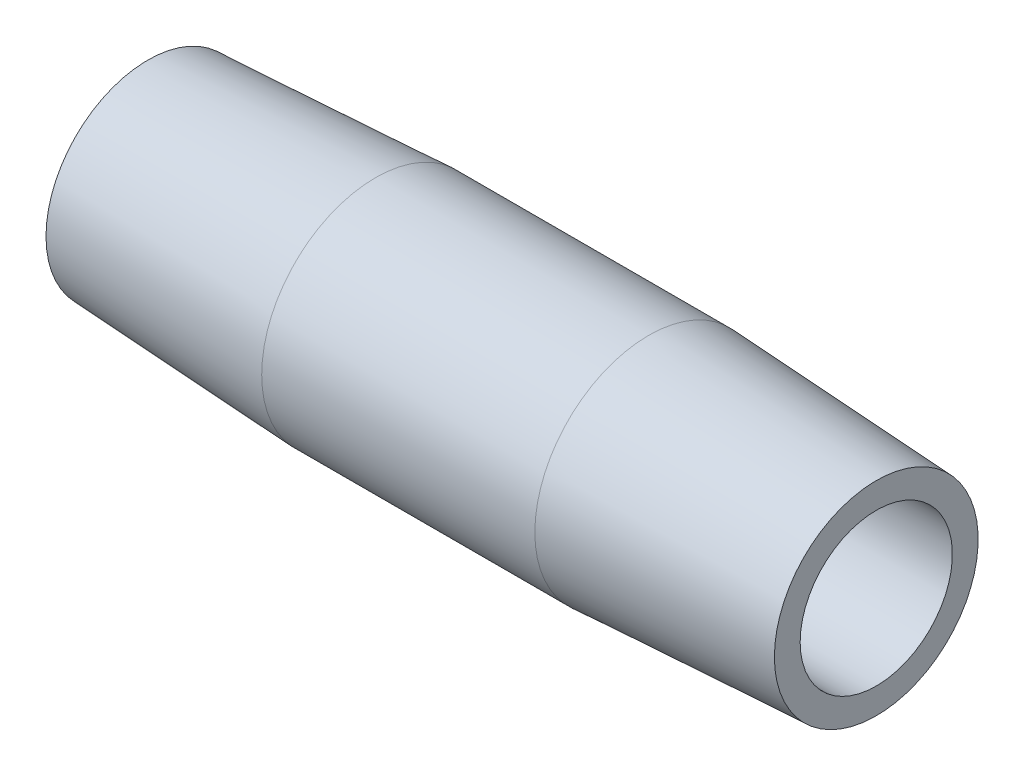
from build123d import *


with BuildPart() as part:
    # Sketch2 → Revolve1 (revolve)
    with BuildSketch(Plane.XY, mode=Mode.PRIVATE) as revolve1_sk:
        Polygon((7.9375, 3.96875), (0, 3.552763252), (0, 2.6543), (25.4, 2.6543), (25.4, 3.552763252), (17.4625, 3.96875), align=None)
    revolve(revolve1_sk.sketch.rotate(Axis((0.476141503, 0, 0), (1, 0, 0)), 90), axis=Axis((0.476141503, 0, 0), (1, 0, 0)))


solid = part.part
